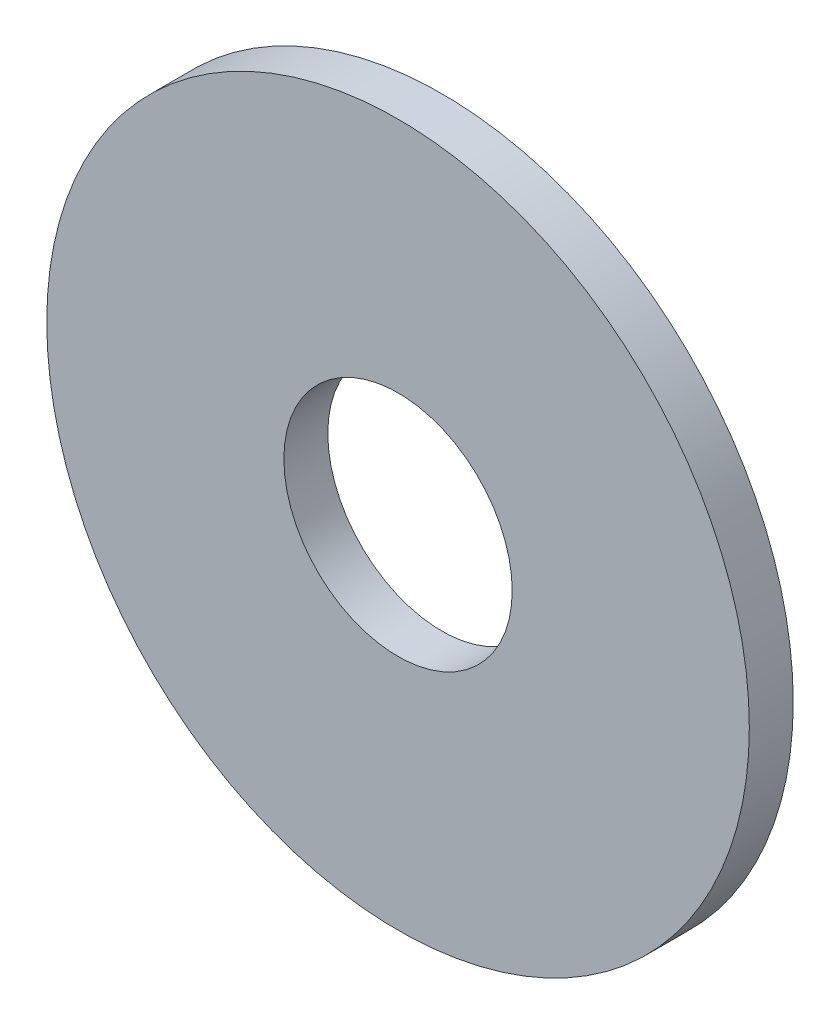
ISO-10303-21;
HEADER;
FILE_DESCRIPTION(('STEP AP214'),'2;1');
FILE_NAME('part.step','',(''),(''),'','','');
FILE_SCHEMA(('AUTOMOTIVE_DESIGN { 1 0 10303 214 1 1 1 1 }'));
ENDSEC;
DATA;
#1=APPLICATION_CONTEXT('core data for automotive mechanical design processes');
#2=APPLICATION_PROTOCOL_DEFINITION('international standard','automotive_design',2000,#1);
#3=PRODUCT_CONTEXT('',#1,'mechanical');
#4=PRODUCT('Part','Part','',(#3));
#5=PRODUCT_RELATED_PRODUCT_CATEGORY('part','',(#4));
#6=PRODUCT_DEFINITION_FORMATION('','',#4);
#7=PRODUCT_DEFINITION_CONTEXT('part definition',#1,'design');
#8=PRODUCT_DEFINITION('design','',#6,#7);
#9=PRODUCT_DEFINITION_SHAPE('','',#8);
#10=(LENGTH_UNIT() NAMED_UNIT(*) SI_UNIT(.MILLI.,.METRE.));
#11=(NAMED_UNIT(*) PLANE_ANGLE_UNIT() SI_UNIT($,.RADIAN.));
#12=(NAMED_UNIT(*) SI_UNIT($,.STERADIAN.) SOLID_ANGLE_UNIT());
#13=UNCERTAINTY_MEASURE_WITH_UNIT(LENGTH_MEASURE(1.E-05),#10,'distance_accuracy_value','');
#14=(GEOMETRIC_REPRESENTATION_CONTEXT(3) GLOBAL_UNCERTAINTY_ASSIGNED_CONTEXT((#13)) GLOBAL_UNIT_ASSIGNED_CONTEXT((#10,
#11,#12)) REPRESENTATION_CONTEXT('',''));
#15=CARTESIAN_POINT('',(0.,0.,0.));
#16=DIRECTION('',(0.,0.,1.));
#17=DIRECTION('',(1.,0.,0.));
#18=AXIS2_PLACEMENT_3D('',#15,#16,#17);
#19=CARTESIAN_POINT('',(0.,0.,2.5));
#20=DIRECTION('',(0.,0.,-1.));
#21=DIRECTION('',(-1.,0.,0.));
#22=AXIS2_PLACEMENT_3D('',#19,#20,#21);
#23=CYLINDRICAL_SURFACE('',#22,20.);
#24=CARTESIAN_POINT('',(0.,0.,2.5));
#25=DIRECTION('',(0.,0.,1.));
#26=DIRECTION('',(1.,0.,0.));
#27=AXIS2_PLACEMENT_3D('',#24,#25,#26);
#28=CIRCLE('',#27,20.);
#29=CARTESIAN_POINT('',(20.,0.,2.5));
#30=VERTEX_POINT('',#29);
#31=EDGE_CURVE('E10',#30,#30,#28,.T.);
#32=ORIENTED_EDGE('',*,*,#31,.F.);
#33=EDGE_LOOP('',(#32));
#34=FACE_BOUND('',#33,.T.);
#35=CARTESIAN_POINT('',(0.,0.,0.));
#36=DIRECTION('',(0.,0.,1.));
#37=DIRECTION('',(1.,0.,0.));
#38=AXIS2_PLACEMENT_3D('',#35,#36,#37);
#39=CIRCLE('',#38,20.);
#40=CARTESIAN_POINT('',(20.,0.,0.));
#41=VERTEX_POINT('',#40);
#42=EDGE_CURVE('E34',#41,#41,#39,.T.);
#43=ORIENTED_EDGE('',*,*,#42,.T.);
#44=EDGE_LOOP('',(#43));
#45=FACE_BOUND('',#44,.T.);
#46=ADVANCED_FACE('F31',(#34,#45),#23,.T.);
#47=CARTESIAN_POINT('',(0.,0.,2.5));
#48=DIRECTION('',(0.,0.,1.));
#49=DIRECTION('',(1.,0.,0.));
#50=AXIS2_PLACEMENT_3D('',#47,#48,#49);
#51=PLANE('',#50);
#52=CARTESIAN_POINT('',(0.,0.,2.5));
#53=DIRECTION('',(0.,0.,-1.));
#54=DIRECTION('',(-1.,0.,0.));
#55=AXIS2_PLACEMENT_3D('',#52,#53,#54);
#56=CIRCLE('',#55,6.5);
#57=CARTESIAN_POINT('',(-6.5,0.,2.5));
#58=VERTEX_POINT('',#57);
#59=EDGE_CURVE('E41',#58,#58,#56,.T.);
#60=ORIENTED_EDGE('',*,*,#59,.T.);
#61=EDGE_LOOP('',(#60));
#62=FACE_BOUND('',#61,.T.);
#63=ORIENTED_EDGE('',*,*,#31,.T.);
#64=EDGE_LOOP('',(#63));
#65=FACE_BOUND('',#64,.T.);
#66=ADVANCED_FACE('F49',(#62,#65),#51,.T.);
#67=CARTESIAN_POINT('',(0.,0.,0.));
#68=DIRECTION('',(0.,0.,1.));
#69=DIRECTION('',(1.,0.,0.));
#70=AXIS2_PLACEMENT_3D('',#67,#68,#69);
#71=PLANE('',#70);
#72=CARTESIAN_POINT('',(0.,0.,0.));
#73=DIRECTION('',(0.,0.,-1.));
#74=DIRECTION('',(-1.,0.,0.));
#75=AXIS2_PLACEMENT_3D('',#72,#73,#74);
#76=CIRCLE('',#75,6.5);
#77=CARTESIAN_POINT('',(-6.5,0.,0.));
#78=VERTEX_POINT('',#77);
#79=EDGE_CURVE('E43',#78,#78,#76,.T.);
#80=ORIENTED_EDGE('',*,*,#79,.F.);
#81=EDGE_LOOP('',(#80));
#82=FACE_BOUND('',#81,.T.);
#83=ORIENTED_EDGE('',*,*,#42,.F.);
#84=EDGE_LOOP('',(#83));
#85=FACE_BOUND('',#84,.T.);
#86=ADVANCED_FACE('F54',(#82,#85),#71,.F.);
#87=CARTESIAN_POINT('',(0.,0.,2.5));
#88=DIRECTION('',(0.,0.,-1.));
#89=DIRECTION('',(-1.,0.,0.));
#90=AXIS2_PLACEMENT_3D('',#87,#88,#89);
#91=CYLINDRICAL_SURFACE('',#90,6.5);
#92=ORIENTED_EDGE('',*,*,#59,.F.);
#93=EDGE_LOOP('',(#92));
#94=FACE_BOUND('',#93,.T.);
#95=ORIENTED_EDGE('',*,*,#79,.T.);
#96=EDGE_LOOP('',(#95));
#97=FACE_BOUND('',#96,.T.);
#98=ADVANCED_FACE('F51',(#94,#97),#91,.F.);
#99=CLOSED_SHELL('',(#46,#66,#86,#98));
#100=MANIFOLD_SOLID_BREP('B2',#99);
#101=ADVANCED_BREP_SHAPE_REPRESENTATION('',(#18,#100),#14);
#102=SHAPE_DEFINITION_REPRESENTATION(#9,#101);
ENDSEC;
END-ISO-10303-21;
